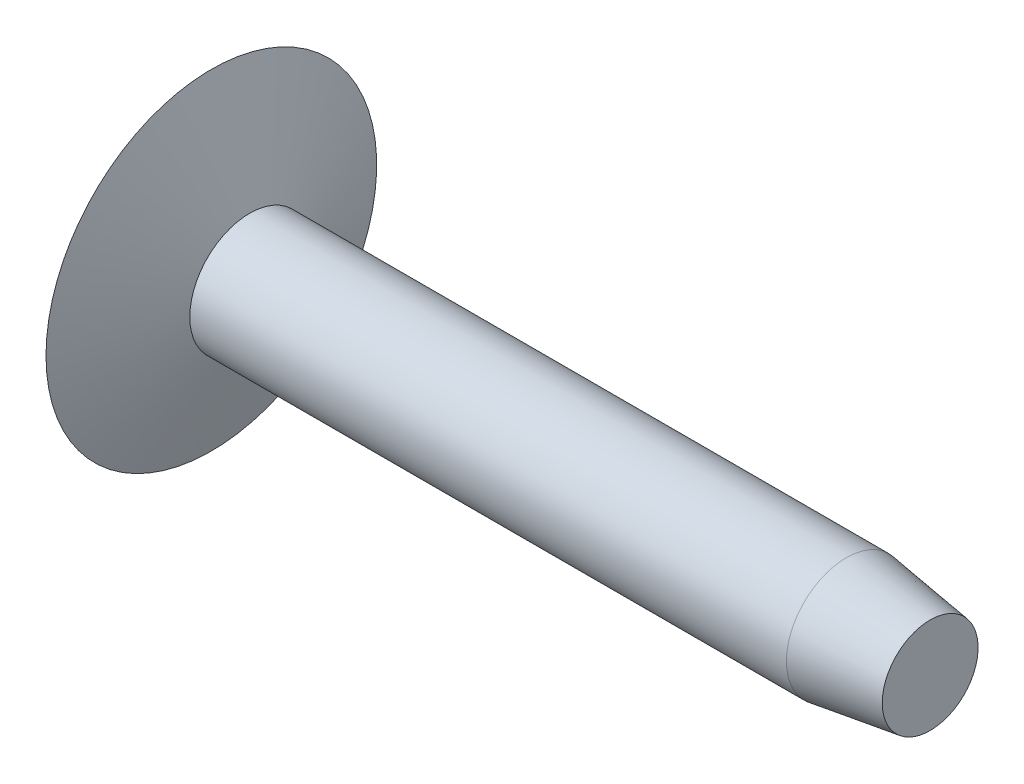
ISO-10303-21;
HEADER;
FILE_DESCRIPTION(('STEP AP214'),'2;1');
FILE_NAME('part.step','',(''),(''),'','','');
FILE_SCHEMA(('AUTOMOTIVE_DESIGN { 1 0 10303 214 1 1 1 1 }'));
ENDSEC;
DATA;
#1=APPLICATION_CONTEXT('core data for automotive mechanical design processes');
#2=APPLICATION_PROTOCOL_DEFINITION('international standard','automotive_design',2000,#1);
#3=PRODUCT_CONTEXT('',#1,'mechanical');
#4=PRODUCT('Part','Part','',(#3));
#5=PRODUCT_RELATED_PRODUCT_CATEGORY('part','',(#4));
#6=PRODUCT_DEFINITION_FORMATION('','',#4);
#7=PRODUCT_DEFINITION_CONTEXT('part definition',#1,'design');
#8=PRODUCT_DEFINITION('design','',#6,#7);
#9=PRODUCT_DEFINITION_SHAPE('','',#8);
#10=(LENGTH_UNIT() NAMED_UNIT(*) SI_UNIT(.MILLI.,.METRE.));
#11=(NAMED_UNIT(*) PLANE_ANGLE_UNIT() SI_UNIT($,.RADIAN.));
#12=(NAMED_UNIT(*) SI_UNIT($,.STERADIAN.) SOLID_ANGLE_UNIT());
#13=UNCERTAINTY_MEASURE_WITH_UNIT(LENGTH_MEASURE(1.E-05),#10,'distance_accuracy_value','');
#14=(GEOMETRIC_REPRESENTATION_CONTEXT(3) GLOBAL_UNCERTAINTY_ASSIGNED_CONTEXT((#13)) GLOBAL_UNIT_ASSIGNED_CONTEXT((#10,
#11,#12)) REPRESENTATION_CONTEXT('',''));
#15=CARTESIAN_POINT('',(0.,0.,0.));
#16=DIRECTION('',(0.,0.,1.));
#17=DIRECTION('',(1.,0.,0.));
#18=AXIS2_PLACEMENT_3D('',#15,#16,#17);
#19=CARTESIAN_POINT('',(0.,0.,0.));
#20=DIRECTION('',(1.,0.,0.));
#21=DIRECTION('',(0.,0.,-1.));
#22=AXIS2_PLACEMENT_3D('',#19,#20,#21);
#23=PLANE('',#22);
#24=CARTESIAN_POINT('',(0.,0.,0.));
#25=DIRECTION('',(-1.,0.,0.));
#26=DIRECTION('',(0.,0.,1.));
#27=AXIS2_PLACEMENT_3D('',#24,#25,#26);
#28=CIRCLE('',#27,6.9);
#29=CARTESIAN_POINT('',(0.,0.,6.9));
#30=VERTEX_POINT('',#29);
#31=EDGE_CURVE('E10',#30,#30,#28,.T.);
#32=ORIENTED_EDGE('',*,*,#31,.T.);
#33=EDGE_LOOP('',(#32));
#34=FACE_BOUND('',#33,.T.);
#35=ADVANCED_FACE('F31',(#34),#23,.F.);
#36=CARTESIAN_POINT('',(1.60146903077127,0.,0.));
#37=DIRECTION('',(-1.,0.,0.));
#38=DIRECTION('',(0.,0.,1.));
#39=AXIS2_PLACEMENT_3D('',#36,#37,#38);
#40=CONICAL_SURFACE('',#39,2.5,1.22173047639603);
#41=ORIENTED_EDGE('',*,*,#31,.F.);
#42=EDGE_LOOP('',(#41));
#43=FACE_BOUND('',#42,.T.);
#44=CARTESIAN_POINT('',(1.60146903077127,0.,0.));
#45=DIRECTION('',(-1.,0.,0.));
#46=DIRECTION('',(0.,0.,1.));
#47=AXIS2_PLACEMENT_3D('',#44,#45,#46);
#48=CIRCLE('',#47,2.5);
#49=CARTESIAN_POINT('',(1.60146903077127,0.,2.5));
#50=VERTEX_POINT('',#49);
#51=EDGE_CURVE('E37',#50,#50,#48,.T.);
#52=ORIENTED_EDGE('',*,*,#51,.T.);
#53=EDGE_LOOP('',(#52));
#54=FACE_BOUND('',#53,.T.);
#55=ADVANCED_FACE('F63',(#43,#54),#40,.T.);
#56=CARTESIAN_POINT('',(0.,0.,0.));
#57=DIRECTION('',(-1.,0.,0.));
#58=DIRECTION('',(0.,0.,1.));
#59=AXIS2_PLACEMENT_3D('',#56,#57,#58);
#60=CYLINDRICAL_SURFACE('',#59,2.5);
#61=ORIENTED_EDGE('',*,*,#51,.F.);
#62=EDGE_LOOP('',(#61));
#63=FACE_BOUND('',#62,.T.);
#64=CARTESIAN_POINT('',(26.5,0.,0.));
#65=DIRECTION('',(-1.,0.,0.));
#66=DIRECTION('',(0.,0.,1.));
#67=AXIS2_PLACEMENT_3D('',#64,#65,#66);
#68=CIRCLE('',#67,2.5);
#69=CARTESIAN_POINT('',(26.5,0.,2.5));
#70=VERTEX_POINT('',#69);
#71=EDGE_CURVE('E41',#70,#70,#68,.T.);
#72=ORIENTED_EDGE('',*,*,#71,.T.);
#73=EDGE_LOOP('',(#72));
#74=FACE_BOUND('',#73,.T.);
#75=ADVANCED_FACE('F59',(#63,#74),#60,.T.);
#76=CARTESIAN_POINT('',(30.,0.,0.));
#77=DIRECTION('',(-1.,0.,0.));
#78=DIRECTION('',(0.,0.,1.));
#79=AXIS2_PLACEMENT_3D('',#76,#77,#78);
#80=CONICAL_SURFACE('',#79,2.,0.141897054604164);
#81=ORIENTED_EDGE('',*,*,#71,.F.);
#82=EDGE_LOOP('',(#81));
#83=FACE_BOUND('',#82,.T.);
#84=CARTESIAN_POINT('',(30.,0.,0.));
#85=DIRECTION('',(-1.,0.,0.));
#86=DIRECTION('',(0.,0.,1.));
#87=AXIS2_PLACEMENT_3D('',#84,#85,#86);
#88=CIRCLE('',#87,2.);
#89=CARTESIAN_POINT('',(30.,0.,2.));
#90=VERTEX_POINT('',#89);
#91=EDGE_CURVE('E45',#90,#90,#88,.T.);
#92=ORIENTED_EDGE('',*,*,#91,.T.);
#93=EDGE_LOOP('',(#92));
#94=FACE_BOUND('',#93,.T.);
#95=ADVANCED_FACE('F51',(#83,#94),#80,.T.);
#96=CARTESIAN_POINT('',(30.,2.,0.));
#97=DIRECTION('',(-1.,0.,0.));
#98=DIRECTION('',(0.,0.,1.));
#99=AXIS2_PLACEMENT_3D('',#96,#97,#98);
#100=PLANE('',#99);
#101=ORIENTED_EDGE('',*,*,#91,.F.);
#102=EDGE_LOOP('',(#101));
#103=FACE_BOUND('',#102,.T.);
#104=ADVANCED_FACE('F53',(#103),#100,.F.);
#105=CLOSED_SHELL('',(#35,#55,#75,#95,#104));
#106=MANIFOLD_SOLID_BREP('B2',#105);
#107=ADVANCED_BREP_SHAPE_REPRESENTATION('',(#18,#106),#14);
#108=SHAPE_DEFINITION_REPRESENTATION(#9,#107);
ENDSEC;
END-ISO-10303-21;
